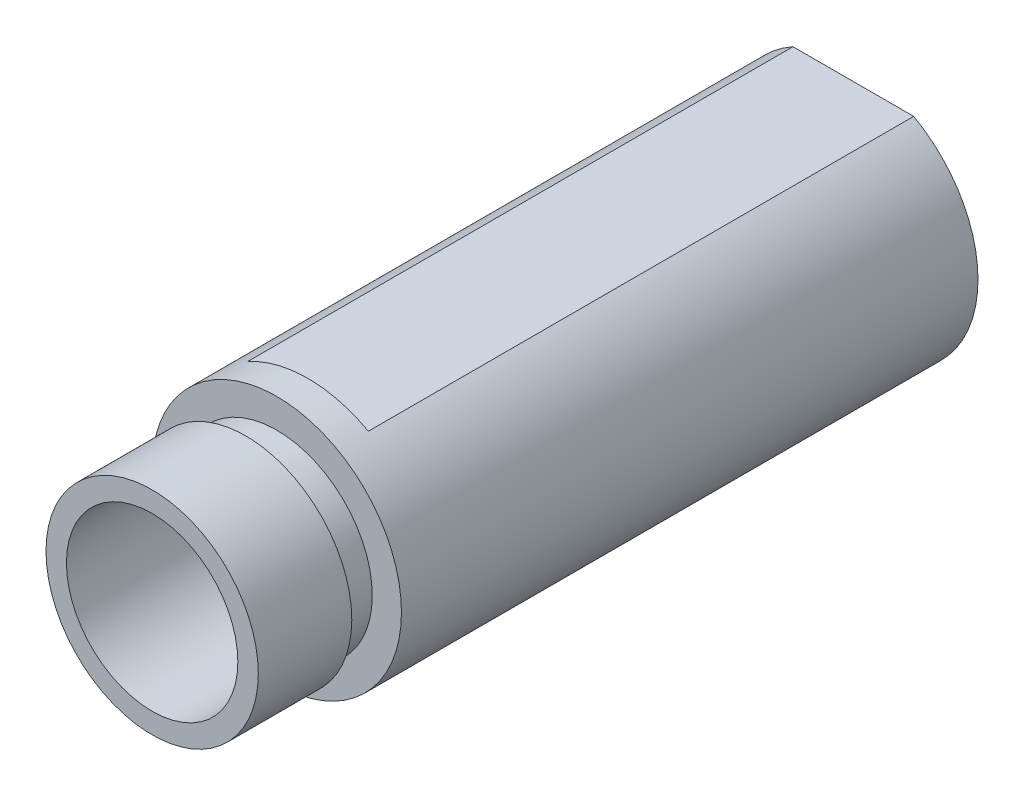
from build123d import *

# Parameters (mm, degrees)
ESQUISSE1_R             = 10
EXTRUSION1_DEPTH        = 45
ESQUISSE2_R             = 5.5
ENL_V_MAT_EXTRU_1_DEPTH = 42
ESQUISSE3_R             = 4
ENL_V_MAT_EXTRU_2_DEPTH = 45.317039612
ESQUISSE4_OUTSIDE_W     = 32.63
ESQUISSE4_OUTSIDE_H     = 32.63
ESQUISSE4_OUTSIDE_R     = 8
ENL_V_MAT_EXTRU_3_DEPTH = 48.16990566
ESQUISSE5_OUTSIDE_W     = 28.074
ESQUISSE5_OUTSIDE_H     = 28.074
ESQUISSE5_OUTSIDE_R     = 6.811875
ENL_V_MAT_EXTRU_4_DEPTH = 6
ESQUISSE6_OUTSIDE_W     = 28.074
ESQUISSE6_OUTSIDE_H     = 28.074
ESQUISSE6_OUTSIDE_R     = 6.125
ENL_V_MAT_EXTRU_5_DEPTH = 2
ESQUISSE7_W             = 28.930289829
ESQUISSE7_H             = 8.868303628
ENL_V_MAT_EXTRU_6_DEPTH = 35


with BuildPart() as part:
    # Esquisse1 → Extrusion1 (new body)
    with BuildSketch(Plane.XY):
        Circle(ESQUISSE1_R)
    extrude(amount=EXTRUSION1_DEPTH)

    # Esquisse2 → Enl_v. mat.-Extru.1 (cut)
    with BuildSketch(Plane.XY.offset(45)):
        Circle(ESQUISSE2_R)
    extrude(amount=-ENL_V_MAT_EXTRU_1_DEPTH, mode=Mode.SUBTRACT)

    # Esquisse3 → Enl_v. mat.-Extru.2 (cut, through all)
    with BuildSketch(Plane.XY.offset(3)):
        Circle(ESQUISSE3_R)
    extrude(amount=-ENL_V_MAT_EXTRU_2_DEPTH, mode=Mode.SUBTRACT)

    # Esquisse4 outside → Enl_v. mat.-Extru.3 (cut, through all)
    with BuildSketch(Plane.XY.offset(45)):
        Rectangle(ESQUISSE4_OUTSIDE_W, ESQUISSE4_OUTSIDE_H)
        Circle(ESQUISSE4_OUTSIDE_R, mode=Mode.SUBTRACT)
    extrude(amount=-ENL_V_MAT_EXTRU_3_DEPTH, mode=Mode.SUBTRACT)

    # Esquisse5 outside → Enl_v. mat.-Extru.4 (cut)
    with BuildSketch(Plane.XY.offset(45)):
        Rectangle(ESQUISSE5_OUTSIDE_W, ESQUISSE5_OUTSIDE_H)
        Circle(ESQUISSE5_OUTSIDE_R, mode=Mode.SUBTRACT)
    extrude(amount=-ENL_V_MAT_EXTRU_4_DEPTH, mode=Mode.SUBTRACT)

    # Esquisse6 outside → Enl_v. mat.-Extru.5 (cut)
    with BuildSketch(Plane.XY.offset(39)):
        Rectangle(ESQUISSE6_OUTSIDE_W, ESQUISSE6_OUTSIDE_H)
        Circle(ESQUISSE6_OUTSIDE_R, mode=Mode.SUBTRACT)
    extrude(amount=-ENL_V_MAT_EXTRU_5_DEPTH, mode=Mode.SUBTRACT)

    # Esquisse7 → Enl_v. mat.-Extru.6 (cut)
    with BuildSketch(Plane(origin=(0, 0, 0), x_dir=(-1, 0, 0), z_dir=(0, 0, -1))):
        with Locations((-2.407208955, 11.434151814)):
            Rectangle(ESQUISSE7_W, ESQUISSE7_H)
    extrude(amount=-ENL_V_MAT_EXTRU_6_DEPTH, mode=Mode.SUBTRACT)


solid = part.part
